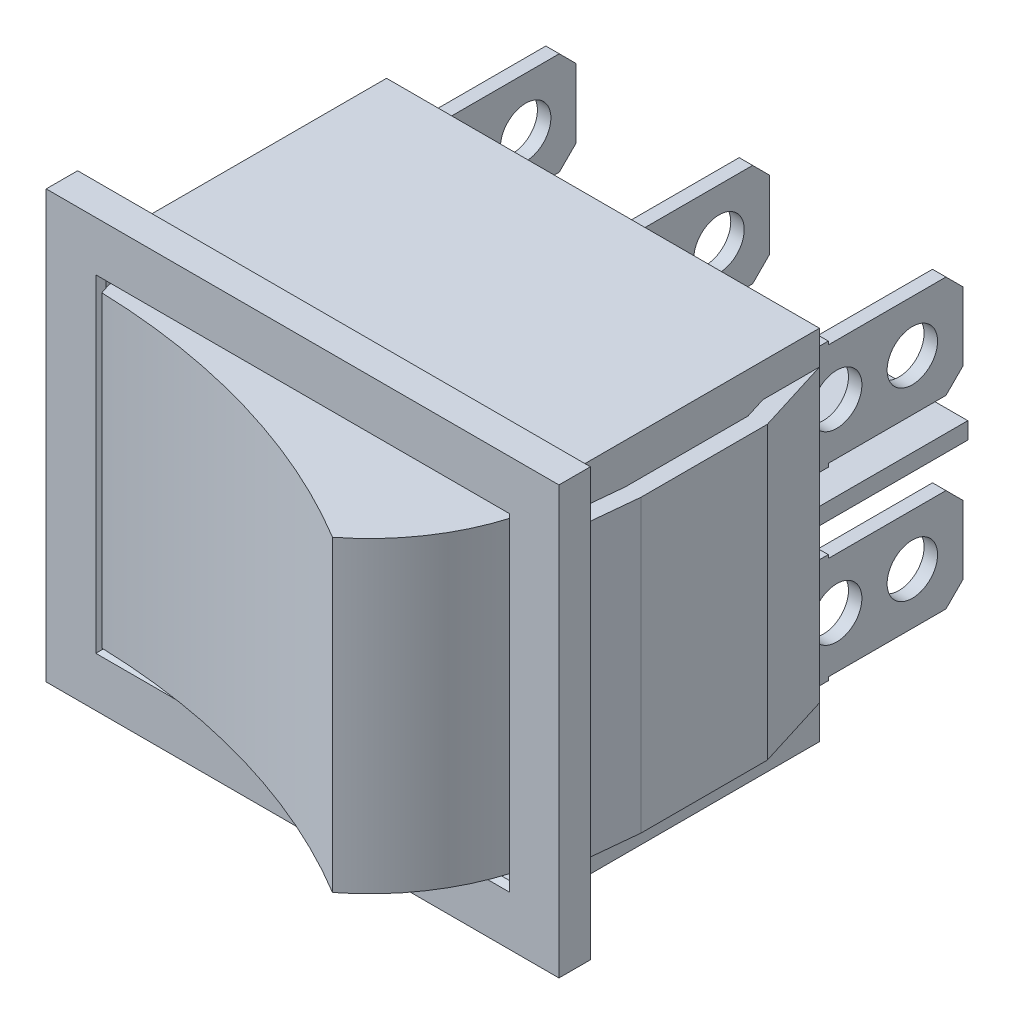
from build123d import *

# Parameters (mm, degrees)
SKETCH1_W                = 25.75
SKETCH1_H                = 21.3
BOSS_EXTRUDE1_DEPTH      = 16
SKETCH3_W                = 30.5
SKETCH3_H                = 25.4
BOSS_EXTRUDE3_DEPTH      = 1.87
SKETCH4_W                = 23.8
SKETCH4_H                = 1
BOSS_EXTRUDE4_DEPTH      = 9.8
SKETCH5_W                = 0.8
SKETCH5_H                = 6.5
BOSS_EXTRUDE5_DEPTH      = 9.5
SKETCH6_W                = 8
SKETCH6_H                = 0.2
CUT_EXTRUDE1_DEPTH       = 35.896266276
CHAMFER1_SIZE            = 1
SKETCH7_R                = 1.5
CUT_EXTRUDE2_DEPTH       = 35.896266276
CHAMFER1_OF_MIRROR1_SIZE = 1
BOSS_EXTRUDE6_START      = -2
BOSS_EXTRUDE6_DEPTH      = 17.3
SKETCH9_W                = 24
SKETCH9_H                = 18.9
CUT_EXTRUDE3_DEPTH       = 5
SKETCH10_R               = 12.5
BOSS_EXTRUDE7_DEPTH      = 9.15
CUT_EXTRUDE4_DEPTH       = 34.003475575
CUT_EXTRUDE4_DEPTH_BACK  = 34.003475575
SKETCH11_R               = 40
CHAMFER2_SIZE            = 0.3


with BuildPart() as part:
    # Sketch1 → Boss-Extrude1 (new body)
    with BuildSketch(Plane.XY):
        Rectangle(SKETCH1_W, SKETCH1_H)
    extrude(amount=BOSS_EXTRUDE1_DEPTH)

    # Sketch3 → Boss-Extrude3 (add)
    with BuildSketch(Plane.XY.offset(16)):
        Rectangle(SKETCH3_W, SKETCH3_H)
    extrude(amount=BOSS_EXTRUDE3_DEPTH)

    # Sketch4 → Boss-Extrude4 (add)
    with BuildSketch(Plane(origin=(0, 0, 0), x_dir=(-1, 0, 0), z_dir=(0, 0, -1))):
        Rectangle(SKETCH4_W, SKETCH4_H)
    extrude(amount=BOSS_EXTRUDE4_DEPTH)

    # Sketch5 → Boss-Extrude5 (add)
    with BuildSketch(Plane(origin=(0, 0, 0), x_dir=(-1, 0, 0), z_dir=(0, 0, -1))):
        with Locations((11.5, -5.5)):
            Rectangle(SKETCH5_W, SKETCH5_H)
        with Locations((0, -5.5)):
            Rectangle(SKETCH5_W, SKETCH5_H)
        with Locations((-11.5, -5.5)):
            Rectangle(SKETCH5_W, SKETCH5_H)
    boss_extrude5 = extrude(amount=BOSS_EXTRUDE5_DEPTH)

    # Sketch6 → Cut-Extrude1 (cut, through all)
    with BuildSketch(Plane(origin=(11.9, 0, 0), x_dir=(0, 0, -1), z_dir=(1, 0, 0))):
        with Locations((5.5, -2.35)):
            Rectangle(SKETCH6_W, SKETCH6_H)
        with Locations((5.5, -8.65)):
            Rectangle(SKETCH6_W, SKETCH6_H)
    cut_extrude1 = extrude(amount=-CUT_EXTRUDE1_DEPTH, mode=Mode.SUBTRACT)

    # Chamfer1
    chamfer1_edges = [part.edges().sort_by_distance(p)[0] for p in [
        (-11.5, -2.45, -9.5),
        (0, -2.45, -9.5),
        (-11.5, -8.55, -9.5),
        (0, -8.55, -9.5),
        (11.5, -8.55, -9.5),
        (11.5, -2.45, -9.5),
    ]]
    chamfer(chamfer1_edges, length=CHAMFER1_SIZE)

    # Sketch7 → Cut-Extrude2 (cut, through all)
    with BuildSketch(Plane(origin=(11.9, 0, 0), x_dir=(0, 0, -1), z_dir=(1, 0, 0))):
        with Locations((6.5, -5.5)):
            Circle(SKETCH7_R)
        with Locations((2, -5.5)):
            Circle(SKETCH7_R)
    cut_extrude2 = extrude(amount=-CUT_EXTRUDE2_DEPTH, mode=Mode.SUBTRACT)

    # Mirror1: Boss-Extrude5, Cut-Extrude1, Cut-Extrude2 across plane
    add(boss_extrude5.mirror(Plane(origin=(0, 0, 0), x_dir=(0, 0, 1), z_dir=(0, -1, 0))))
    add(cut_extrude1.mirror(Plane(origin=(0, 0, 0), x_dir=(0, 0, 1), z_dir=(0, -1, 0))), mode=Mode.SUBTRACT)
    add(cut_extrude2.mirror(Plane(origin=(0, 0, 0), x_dir=(0, 0, 1), z_dir=(0, -1, 0))), mode=Mode.SUBTRACT)

    # Chamfer1 of Mirror1
    chamfer1_of_mirror1_edges = [part.edges().sort_by_distance(p)[0] for p in [
        (-11.5, 2.45, -9.5),
        (0, 2.45, -9.5),
        (-11.5, 8.55, -9.5),
        (0, 8.55, -9.5),
        (11.5, 8.55, -9.5),
        (11.5, 2.45, -9.5),
    ]]
    chamfer(chamfer1_of_mirror1_edges, length=CHAMFER1_OF_MIRROR1_SIZE)

    # Sketch8 → Boss-Extrude6 (add)
    with BuildSketch(Plane(origin=(0, 10.65, 0), x_dir=(1, 0, 0), z_dir=(0, 1, 0)).offset(BOSS_EXTRUDE6_START)):
        Polygon((-12.875, 0), (-14.275, -4.5), (-14.275, -12), (-13.879867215, -16), (-12.875, -16), (-13.275, -11.95072831), (-13.275, -4.651963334), (-12.875, -3.366249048), align=None)
    boss_extrude6 = extrude(amount=-BOSS_EXTRUDE6_DEPTH)

    # Mirror2: Boss-Extrude6 across plane
    add(boss_extrude6.mirror(Plane.ZY))

    # Sketch9 → Cut-Extrude3 (cut)
    with BuildSketch(Plane.XY.offset(17.87)):
        Rectangle(SKETCH9_W, SKETCH9_H)
    extrude(amount=-CUT_EXTRUDE3_DEPTH, mode=Mode.SUBTRACT)

    # Sketch10 → Boss-Extrude7 (add, symmetric)
    with BuildSketch(Plane(origin=(0, 0, 0), x_dir=(-1, 0, 0), z_dir=(0, -1, 0))):
        with Locations((0, -13.87)):
            Circle(SKETCH10_R)
    extrude(amount=BOSS_EXTRUDE7_DEPTH, both=True)

    # Sketch11 → Cut-Extrude4 (cut, two sides: drawn at the far end of the back side and taken through both)
    with BuildSketch(Plane(origin=(0, 0, 0), x_dir=(-1, 0, 0), z_dir=(0, -1, 0)).offset(-CUT_EXTRUDE4_DEPTH_BACK)):
        with Locations((13, -58)):
            Circle(SKETCH11_R)
    extrude(amount=CUT_EXTRUDE4_DEPTH + CUT_EXTRUDE4_DEPTH_BACK, mode=Mode.SUBTRACT)

    # Chamfer2
    chamfer2_edges = [part.edges().sort_by_distance(p)[0] for p in [
        (-12, 0, 17.87),
        (0, 9.45, 17.87),
        (0, -9.45, 17.87),
        (12, 0, 17.87),
    ]]
    chamfer(chamfer2_edges, length=CHAMFER2_SIZE)


solid = part.part
